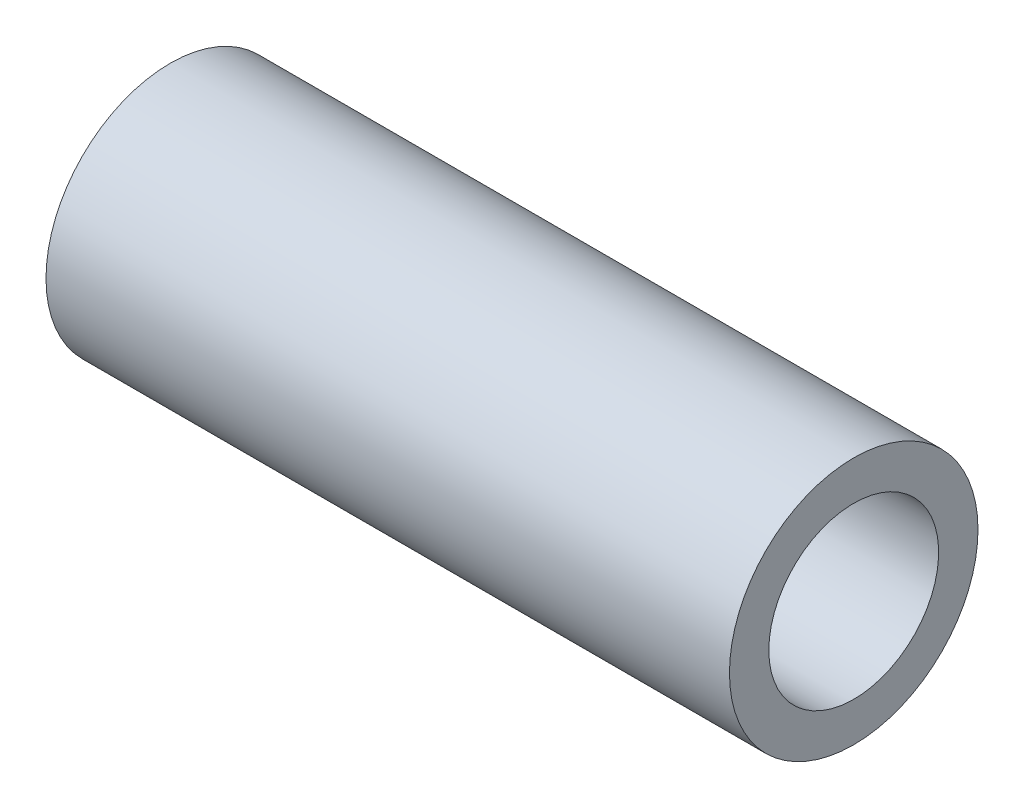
from build123d import *

# Parameters (mm, degrees)
ESQUISSE2_R      = 6
ESQUISSE2_R_2    = 4.1
EXTRUSION1_DEPTH = 16.5


with BuildPart() as part:
    # Esquisse2 → Extrusion1 (new, symmetric)
    with BuildSketch(Plane.ZY):
        with Locations((2, 380)):
            Circle(ESQUISSE2_R)
        with Locations((2, 380)):
            Circle(ESQUISSE2_R_2, mode=Mode.SUBTRACT)
    extrude(amount=EXTRUSION1_DEPTH, both=True)


solid = part.part
